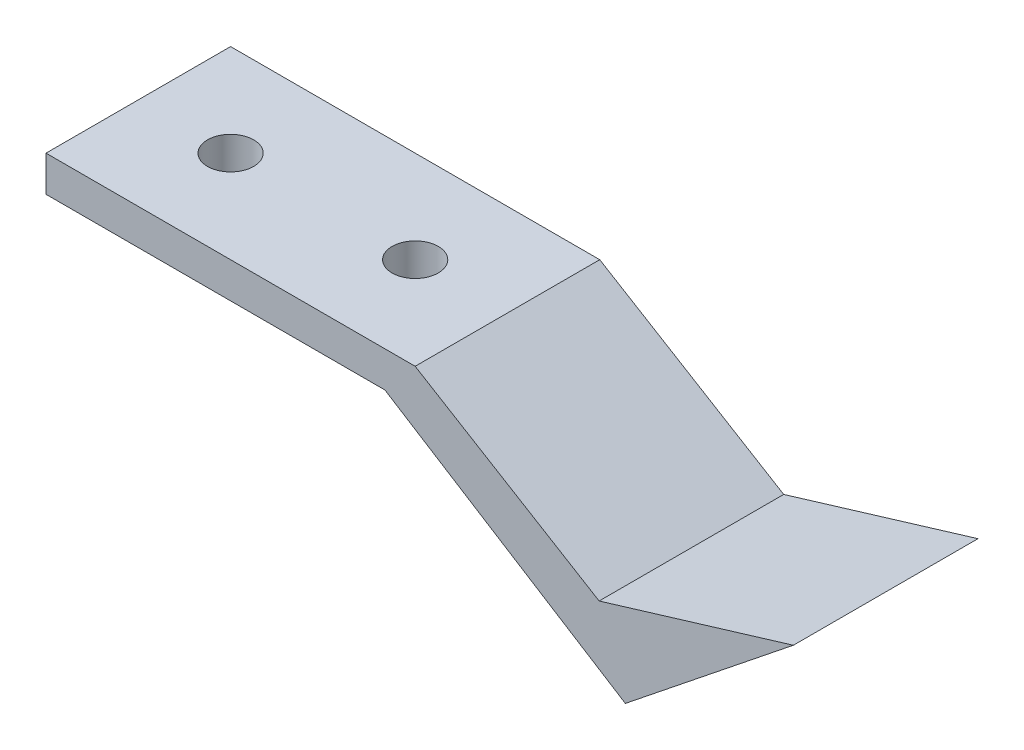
ISO-10303-21;
HEADER;
FILE_DESCRIPTION(('STEP AP214'),'2;1');
FILE_NAME('part.step','',(''),(''),'','','');
FILE_SCHEMA(('AUTOMOTIVE_DESIGN { 1 0 10303 214 1 1 1 1 }'));
ENDSEC;
DATA;
#1=APPLICATION_CONTEXT('core data for automotive mechanical design processes');
#2=APPLICATION_PROTOCOL_DEFINITION('international standard','automotive_design',2000,#1);
#3=PRODUCT_CONTEXT('',#1,'mechanical');
#4=PRODUCT('Part','Part','',(#3));
#5=PRODUCT_RELATED_PRODUCT_CATEGORY('part','',(#4));
#6=PRODUCT_DEFINITION_FORMATION('','',#4);
#7=PRODUCT_DEFINITION_CONTEXT('part definition',#1,'design');
#8=PRODUCT_DEFINITION('design','',#6,#7);
#9=PRODUCT_DEFINITION_SHAPE('','',#8);
#10=(LENGTH_UNIT() NAMED_UNIT(*) SI_UNIT(.MILLI.,.METRE.));
#11=(NAMED_UNIT(*) PLANE_ANGLE_UNIT() SI_UNIT($,.RADIAN.));
#12=(NAMED_UNIT(*) SI_UNIT($,.STERADIAN.) SOLID_ANGLE_UNIT());
#13=UNCERTAINTY_MEASURE_WITH_UNIT(LENGTH_MEASURE(1.E-05),#10,'distance_accuracy_value','');
#14=(GEOMETRIC_REPRESENTATION_CONTEXT(3) GLOBAL_UNCERTAINTY_ASSIGNED_CONTEXT((#13)) GLOBAL_UNIT_ASSIGNED_CONTEXT((#10,
#11,#12)) REPRESENTATION_CONTEXT('',''));
#15=CARTESIAN_POINT('',(0.,0.,0.));
#16=DIRECTION('',(0.,0.,1.));
#17=DIRECTION('',(1.,0.,0.));
#18=AXIS2_PLACEMENT_3D('',#15,#16,#17);
#19=CARTESIAN_POINT('',(-12.7,-1.22731092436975,12.7));
#20=DIRECTION('',(1.,0.,0.));
#21=DIRECTION('',(0.,0.,-1.));
#22=AXIS2_PLACEMENT_3D('',#19,#20,#21);
#23=PLANE('',#22);
#24=DIRECTION('',(0.,-1.,0.));
#25=VECTOR('',#24,1.);
#26=CARTESIAN_POINT('',(-12.7,-1.22731092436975,0.));
#27=LINE('',#26,#25);
#28=CARTESIAN_POINT('',(-12.7,1.22731092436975,0.));
#29=VERTEX_POINT('',#28);
#30=CARTESIAN_POINT('',(-12.7,-1.22731092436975,0.));
#31=VERTEX_POINT('',#30);
#32=EDGE_CURVE('E134',#29,#31,#27,.T.);
#33=ORIENTED_EDGE('',*,*,#32,.T.);
#34=DIRECTION('',(0.,0.,-1.));
#35=VECTOR('',#34,1.);
#36=CARTESIAN_POINT('',(-12.7,-1.22731092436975,12.7));
#37=LINE('',#36,#35);
#38=CARTESIAN_POINT('',(-12.7,-1.22731092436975,12.7));
#39=VERTEX_POINT('',#38);
#40=EDGE_CURVE('E11',#39,#31,#37,.T.);
#41=ORIENTED_EDGE('',*,*,#40,.F.);
#42=DIRECTION('',(0.,-1.,0.));
#43=VECTOR('',#42,1.);
#44=CARTESIAN_POINT('',(-12.7,-1.22731092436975,12.7));
#45=LINE('',#44,#43);
#46=CARTESIAN_POINT('',(-12.7,1.22731092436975,12.7));
#47=VERTEX_POINT('',#46);
#48=EDGE_CURVE('E154',#47,#39,#45,.T.);
#49=ORIENTED_EDGE('',*,*,#48,.F.);
#50=DIRECTION('',(0.,0.,-1.));
#51=VECTOR('',#50,1.);
#52=CARTESIAN_POINT('',(-12.7,1.22731092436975,12.7));
#53=LINE('',#52,#51);
#54=EDGE_CURVE('E130',#47,#29,#53,.T.);
#55=ORIENTED_EDGE('',*,*,#54,.T.);
#56=EDGE_LOOP('',(#33,#41,#49,#55));
#57=FACE_BOUND('',#56,.T.);
#58=ADVANCED_FACE('F39',(#57),#23,.F.);
#59=CARTESIAN_POINT('',(10.6189075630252,-1.22731092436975,12.7));
#60=DIRECTION('',(0.,1.,0.));
#61=DIRECTION('',(0.,0.,1.));
#62=AXIS2_PLACEMENT_3D('',#59,#60,#61);
#63=PLANE('',#62);
#64=CARTESIAN_POINT('',(-6.35,-1.22731092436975,6.35));
#65=DIRECTION('',(0.,1.,0.));
#66=DIRECTION('',(0.,0.,1.));
#67=AXIS2_PLACEMENT_3D('',#64,#65,#66);
#68=CIRCLE('',#67,1.5875);
#69=CARTESIAN_POINT('',(-6.35,-1.22731092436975,7.9375));
#70=VERTEX_POINT('',#69);
#71=EDGE_CURVE('E139',#70,#70,#68,.T.);
#72=ORIENTED_EDGE('',*,*,#71,.T.);
#73=EDGE_LOOP('',(#72));
#74=FACE_BOUND('',#73,.T.);
#75=CARTESIAN_POINT('',(6.35,-1.22731092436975,6.35));
#76=DIRECTION('',(0.,1.,0.));
#77=DIRECTION('',(0.,0.,1.));
#78=AXIS2_PLACEMENT_3D('',#75,#76,#77);
#79=CIRCLE('',#78,1.5875);
#80=CARTESIAN_POINT('',(6.35,-1.22731092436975,7.9375));
#81=VERTEX_POINT('',#80);
#82=EDGE_CURVE('E189',#81,#81,#79,.T.);
#83=ORIENTED_EDGE('',*,*,#82,.T.);
#84=EDGE_LOOP('',(#83));
#85=FACE_BOUND('',#84,.T.);
#86=DIRECTION('',(1.,0.,0.));
#87=VECTOR('',#86,1.);
#88=CARTESIAN_POINT('',(10.6189075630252,-1.22731092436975,0.));
#89=LINE('',#88,#87);
#90=CARTESIAN_POINT('',(10.6189075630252,-1.22731092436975,0.));
#91=VERTEX_POINT('',#90);
#92=EDGE_CURVE('E138',#31,#91,#89,.T.);
#93=ORIENTED_EDGE('',*,*,#92,.T.);
#94=DIRECTION('',(0.,0.,-1.));
#95=VECTOR('',#94,1.);
#96=CARTESIAN_POINT('',(10.6189075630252,-1.22731092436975,12.7));
#97=LINE('',#96,#95);
#98=CARTESIAN_POINT('',(10.6189075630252,-1.22731092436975,12.7));
#99=VERTEX_POINT('',#98);
#100=EDGE_CURVE('E48',#99,#91,#97,.T.);
#101=ORIENTED_EDGE('',*,*,#100,.F.);
#102=DIRECTION('',(1.,0.,0.));
#103=VECTOR('',#102,1.);
#104=CARTESIAN_POINT('',(10.6189075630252,-1.22731092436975,12.7));
#105=LINE('',#104,#103);
#106=EDGE_CURVE('E96',#39,#99,#105,.T.);
#107=ORIENTED_EDGE('',*,*,#106,.F.);
#108=ORIENTED_EDGE('',*,*,#40,.T.);
#109=EDGE_LOOP('',(#93,#101,#107,#108));
#110=FACE_BOUND('',#109,.T.);
#111=ADVANCED_FACE('F217',(#74,#85,#110),#63,.F.);
#112=CARTESIAN_POINT('',(10.6189075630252,-1.22731092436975,12.7));
#113=DIRECTION('',(0.532451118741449,0.846460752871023,0.));
#114=DIRECTION('',(-0.846460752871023,0.532451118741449,0.));
#115=AXIS2_PLACEMENT_3D('',#112,#113,#114);
#116=PLANE('',#115);
#117=DIRECTION('',(0.846460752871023,-0.532451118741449,0.));
#118=VECTOR('',#117,1.);
#119=CARTESIAN_POINT('',(10.6189075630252,-1.22731092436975,0.));
#120=LINE('',#119,#118);
#121=CARTESIAN_POINT('',(27.1609243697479,-11.6327731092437,0.));
#122=VERTEX_POINT('',#121);
#123=EDGE_CURVE('E142',#91,#122,#120,.T.);
#124=ORIENTED_EDGE('',*,*,#123,.T.);
#125=DIRECTION('',(0.,0.,-1.));
#126=VECTOR('',#125,1.);
#127=CARTESIAN_POINT('',(27.1609243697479,-11.6327731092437,12.7));
#128=LINE('',#127,#126);
#129=CARTESIAN_POINT('',(27.1609243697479,-11.6327731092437,12.7));
#130=VERTEX_POINT('',#129);
#131=EDGE_CURVE('E161',#130,#122,#128,.T.);
#132=ORIENTED_EDGE('',*,*,#131,.F.);
#133=DIRECTION('',(0.846460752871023,-0.532451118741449,0.));
#134=VECTOR('',#133,1.);
#135=CARTESIAN_POINT('',(10.6189075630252,-1.22731092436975,12.7));
#136=LINE('',#135,#134);
#137=EDGE_CURVE('E171',#99,#130,#136,.T.);
#138=ORIENTED_EDGE('',*,*,#137,.F.);
#139=ORIENTED_EDGE('',*,*,#100,.T.);
#140=EDGE_LOOP('',(#124,#132,#138,#139));
#141=FACE_BOUND('',#140,.T.);
#142=ADVANCED_FACE('F169',(#141),#116,.F.);
#143=CARTESIAN_POINT('',(27.1609243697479,-11.6327731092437,12.7));
#144=DIRECTION('',(-0.624632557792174,0.780918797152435,0.));
#145=DIRECTION('',(-0.780918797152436,-0.624632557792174,0.));
#146=AXIS2_PLACEMENT_3D('',#143,#144,#145);
#147=PLANE('',#146);
#148=DIRECTION('',(0.780918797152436,0.624632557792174,0.));
#149=VECTOR('',#148,1.);
#150=CARTESIAN_POINT('',(27.1609243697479,-11.6327731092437,0.));
#151=LINE('',#150,#149);
#152=CARTESIAN_POINT('',(38.7244131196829,-2.38349958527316,0.));
#153=VERTEX_POINT('',#152);
#154=EDGE_CURVE('E145',#122,#153,#151,.T.);
#155=ORIENTED_EDGE('',*,*,#154,.T.);
#156=DIRECTION('',(0.,0.,-1.));
#157=VECTOR('',#156,1.);
#158=CARTESIAN_POINT('',(38.7244131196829,-2.38349958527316,12.7));
#159=LINE('',#158,#157);
#160=CARTESIAN_POINT('',(38.7244131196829,-2.38349958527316,12.7));
#161=VERTEX_POINT('',#160);
#162=EDGE_CURVE('E123',#161,#153,#159,.T.);
#163=ORIENTED_EDGE('',*,*,#162,.F.);
#164=DIRECTION('',(0.780918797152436,0.624632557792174,0.));
#165=VECTOR('',#164,1.);
#166=CARTESIAN_POINT('',(27.1609243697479,-11.6327731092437,12.7));
#167=LINE('',#166,#165);
#168=EDGE_CURVE('E112',#130,#161,#167,.T.);
#169=ORIENTED_EDGE('',*,*,#168,.F.);
#170=ORIENTED_EDGE('',*,*,#131,.T.);
#171=EDGE_LOOP('',(#155,#163,#169,#170));
#172=FACE_BOUND('',#171,.T.);
#173=ADVANCED_FACE('F177',(#172),#147,.F.);
#174=CARTESIAN_POINT('',(38.7244131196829,-2.38349958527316,12.7));
#175=DIRECTION('',(0.289738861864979,-0.95710573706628,0.));
#176=DIRECTION('',(0.95710573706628,0.289738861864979,0.));
#177=AXIS2_PLACEMENT_3D('',#174,#175,#176);
#178=PLANE('',#177);
#179=DIRECTION('',(-0.95710573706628,-0.289738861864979,0.));
#180=VECTOR('',#179,1.);
#181=CARTESIAN_POINT('',(38.7244131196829,-2.38349958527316,0.));
#182=LINE('',#181,#180);
#183=CARTESIAN_POINT('',(25.3573109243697,-6.43004201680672,0.));
#184=VERTEX_POINT('',#183);
#185=EDGE_CURVE('E121',#153,#184,#182,.T.);
#186=ORIENTED_EDGE('',*,*,#185,.T.);
#187=DIRECTION('',(0.,0.,-1.));
#188=VECTOR('',#187,1.);
#189=CARTESIAN_POINT('',(25.3573109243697,-6.43004201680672,12.7));
#190=LINE('',#189,#188);
#191=CARTESIAN_POINT('',(25.3573109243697,-6.43004201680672,12.7));
#192=VERTEX_POINT('',#191);
#193=EDGE_CURVE('E118',#192,#184,#190,.T.);
#194=ORIENTED_EDGE('',*,*,#193,.F.);
#195=DIRECTION('',(-0.95710573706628,-0.289738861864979,0.));
#196=VECTOR('',#195,1.);
#197=CARTESIAN_POINT('',(38.7244131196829,-2.38349958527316,12.7));
#198=LINE('',#197,#196);
#199=EDGE_CURVE('E106',#161,#192,#198,.T.);
#200=ORIENTED_EDGE('',*,*,#199,.F.);
#201=ORIENTED_EDGE('',*,*,#162,.T.);
#202=EDGE_LOOP('',(#186,#194,#200,#201));
#203=FACE_BOUND('',#202,.T.);
#204=ADVANCED_FACE('F119',(#203),#178,.F.);
#205=CARTESIAN_POINT('',(25.3573109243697,-6.43004201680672,12.7));
#206=DIRECTION('',(-0.517622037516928,-0.855609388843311,0.));
#207=DIRECTION('',(0.855609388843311,-0.517622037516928,0.));
#208=AXIS2_PLACEMENT_3D('',#205,#206,#207);
#209=PLANE('',#208);
#210=DIRECTION('',(-0.855609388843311,0.517622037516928,0.));
#211=VECTOR('',#210,1.);
#212=CARTESIAN_POINT('',(25.3573109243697,-6.43004201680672,0.));
#213=LINE('',#212,#211);
#214=CARTESIAN_POINT('',(12.7,1.22731092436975,0.));
#215=VERTEX_POINT('',#214);
#216=EDGE_CURVE('E82',#184,#215,#213,.T.);
#217=ORIENTED_EDGE('',*,*,#216,.T.);
#218=DIRECTION('',(0.,0.,-1.));
#219=VECTOR('',#218,1.);
#220=CARTESIAN_POINT('',(12.7,1.22731092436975,12.7));
#221=LINE('',#220,#219);
#222=CARTESIAN_POINT('',(12.7,1.22731092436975,12.7));
#223=VERTEX_POINT('',#222);
#224=EDGE_CURVE('E124',#223,#215,#221,.T.);
#225=ORIENTED_EDGE('',*,*,#224,.F.);
#226=DIRECTION('',(-0.855609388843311,0.517622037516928,0.));
#227=VECTOR('',#226,1.);
#228=CARTESIAN_POINT('',(25.3573109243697,-6.43004201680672,12.7));
#229=LINE('',#228,#227);
#230=EDGE_CURVE('E110',#192,#223,#229,.T.);
#231=ORIENTED_EDGE('',*,*,#230,.F.);
#232=ORIENTED_EDGE('',*,*,#193,.T.);
#233=EDGE_LOOP('',(#217,#225,#231,#232));
#234=FACE_BOUND('',#233,.T.);
#235=ADVANCED_FACE('F126',(#234),#209,.F.);
#236=CARTESIAN_POINT('',(12.7,1.22731092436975,12.7));
#237=DIRECTION('',(0.,-1.,0.));
#238=DIRECTION('',(0.,0.,-1.));
#239=AXIS2_PLACEMENT_3D('',#236,#237,#238);
#240=PLANE('',#239);
#241=CARTESIAN_POINT('',(-6.35,1.22731092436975,6.35));
#242=DIRECTION('',(0.,1.,0.));
#243=DIRECTION('',(0.,0.,1.));
#244=AXIS2_PLACEMENT_3D('',#241,#242,#243);
#245=CIRCLE('',#244,1.5875);
#246=CARTESIAN_POINT('',(-6.35,1.22731092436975,7.9375));
#247=VERTEX_POINT('',#246);
#248=EDGE_CURVE('E193',#247,#247,#245,.T.);
#249=ORIENTED_EDGE('',*,*,#248,.F.);
#250=EDGE_LOOP('',(#249));
#251=FACE_BOUND('',#250,.T.);
#252=CARTESIAN_POINT('',(6.35,1.22731092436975,6.35));
#253=DIRECTION('',(0.,1.,0.));
#254=DIRECTION('',(0.,0.,1.));
#255=AXIS2_PLACEMENT_3D('',#252,#253,#254);
#256=CIRCLE('',#255,1.5875);
#257=CARTESIAN_POINT('',(6.35,1.22731092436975,7.9375));
#258=VERTEX_POINT('',#257);
#259=EDGE_CURVE('E194',#258,#258,#256,.T.);
#260=ORIENTED_EDGE('',*,*,#259,.F.);
#261=EDGE_LOOP('',(#260));
#262=FACE_BOUND('',#261,.T.);
#263=DIRECTION('',(-1.,0.,0.));
#264=VECTOR('',#263,1.);
#265=CARTESIAN_POINT('',(12.7,1.22731092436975,0.));
#266=LINE('',#265,#264);
#267=EDGE_CURVE('E88',#215,#29,#266,.T.);
#268=ORIENTED_EDGE('',*,*,#267,.T.);
#269=ORIENTED_EDGE('',*,*,#54,.F.);
#270=DIRECTION('',(-1.,0.,0.));
#271=VECTOR('',#270,1.);
#272=CARTESIAN_POINT('',(12.7,1.22731092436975,12.7));
#273=LINE('',#272,#271);
#274=EDGE_CURVE('E56',#223,#47,#273,.T.);
#275=ORIENTED_EDGE('',*,*,#274,.F.);
#276=ORIENTED_EDGE('',*,*,#224,.T.);
#277=EDGE_LOOP('',(#268,#269,#275,#276));
#278=FACE_BOUND('',#277,.T.);
#279=ADVANCED_FACE('F205',(#251,#262,#278),#240,.F.);
#280=CARTESIAN_POINT('',(0.,0.,12.7));
#281=DIRECTION('',(0.,0.,1.));
#282=DIRECTION('',(1.,0.,0.));
#283=AXIS2_PLACEMENT_3D('',#280,#281,#282);
#284=PLANE('',#283);
#285=ORIENTED_EDGE('',*,*,#48,.T.);
#286=ORIENTED_EDGE('',*,*,#106,.T.);
#287=ORIENTED_EDGE('',*,*,#137,.T.);
#288=ORIENTED_EDGE('',*,*,#168,.T.);
#289=ORIENTED_EDGE('',*,*,#199,.T.);
#290=ORIENTED_EDGE('',*,*,#230,.T.);
#291=ORIENTED_EDGE('',*,*,#274,.T.);
#292=EDGE_LOOP('',(#285,#286,#287,#288,#289,#290,#291));
#293=FACE_BOUND('',#292,.T.);
#294=ADVANCED_FACE('F108',(#293),#284,.T.);
#295=CARTESIAN_POINT('',(0.,0.,0.));
#296=DIRECTION('',(0.,0.,1.));
#297=DIRECTION('',(1.,0.,0.));
#298=AXIS2_PLACEMENT_3D('',#295,#296,#297);
#299=PLANE('',#298);
#300=ORIENTED_EDGE('',*,*,#32,.F.);
#301=ORIENTED_EDGE('',*,*,#267,.F.);
#302=ORIENTED_EDGE('',*,*,#216,.F.);
#303=ORIENTED_EDGE('',*,*,#185,.F.);
#304=ORIENTED_EDGE('',*,*,#154,.F.);
#305=ORIENTED_EDGE('',*,*,#123,.F.);
#306=ORIENTED_EDGE('',*,*,#92,.F.);
#307=EDGE_LOOP('',(#300,#301,#302,#303,#304,#305,#306));
#308=FACE_BOUND('',#307,.T.);
#309=ADVANCED_FACE('F175',(#308),#299,.F.);
#310=CARTESIAN_POINT('',(6.35,-11.4726890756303,6.35));
#311=DIRECTION('',(0.,1.,0.));
#312=DIRECTION('',(0.,0.,1.));
#313=AXIS2_PLACEMENT_3D('',#310,#311,#312);
#314=CYLINDRICAL_SURFACE('',#313,1.5875);
#315=ORIENTED_EDGE('',*,*,#259,.T.);
#316=EDGE_LOOP('',(#315));
#317=FACE_BOUND('',#316,.T.);
#318=ORIENTED_EDGE('',*,*,#82,.F.);
#319=EDGE_LOOP('',(#318));
#320=FACE_BOUND('',#319,.T.);
#321=ADVANCED_FACE('F211',(#317,#320),#314,.F.);
#322=CARTESIAN_POINT('',(-6.35,-11.4726890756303,6.35));
#323=DIRECTION('',(0.,1.,0.));
#324=DIRECTION('',(0.,0.,1.));
#325=AXIS2_PLACEMENT_3D('',#322,#323,#324);
#326=CYLINDRICAL_SURFACE('',#325,1.5875);
#327=ORIENTED_EDGE('',*,*,#248,.T.);
#328=EDGE_LOOP('',(#327));
#329=FACE_BOUND('',#328,.T.);
#330=ORIENTED_EDGE('',*,*,#71,.F.);
#331=EDGE_LOOP('',(#330));
#332=FACE_BOUND('',#331,.T.);
#333=ADVANCED_FACE('F202',(#329,#332),#326,.F.);
#334=CLOSED_SHELL('',(#58,#111,#142,#173,#204,#235,#279,#294,#309,#321,#333));
#335=MANIFOLD_SOLID_BREP('B2',#334);
#336=ADVANCED_BREP_SHAPE_REPRESENTATION('',(#18,#335),#14);
#337=SHAPE_DEFINITION_REPRESENTATION(#9,#336);
ENDSEC;
END-ISO-10303-21;
